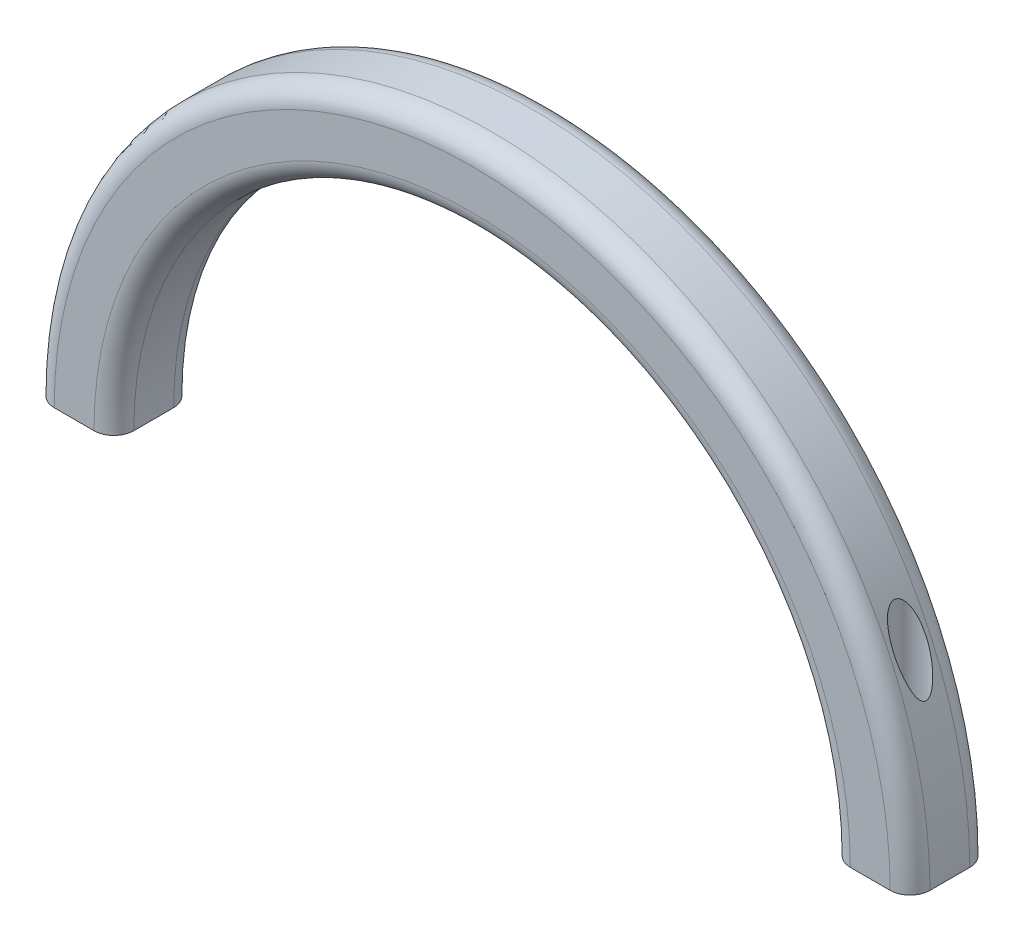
from build123d import *

# Parameters (mm, degrees)
BOSS_EXTRUDE1_DEPTH     = 6.35
F_1_4_20_TAPPED_HOLE1_D = 5.1054
FILLET1_R               = 3.175


with BuildPart() as part:
    # Sketch1 → Boss-Extrude1 (new, symmetric)
    with BuildSketch(Plane.XY):
        with BuildLine():
            ThreePointArc((69.85, 0), (0, 69.85), (-69.85, 0))
            Line((-69.85, 0), (-57.15, 0))
            ThreePointArc((-57.15, 0), (0, 57.15), (57.15, 0))
            Line((57.15, 0), (69.85, 0))
        make_face()
    extrude(amount=BOSS_EXTRUDE1_DEPTH, both=True)

    # 1_4-20 Tapped Hole1 (through all)
    with Locations(Plane(origin=(0, 0, 0), x_dir=(-1, 0, 0), z_dir=(0, -1, 0))):
        with Locations((63.5, 0), (-63.5, 0)):
            Hole(F_1_4_20_TAPPED_HOLE1_D / 2)

    # Fillet1
    fillet1_edges = [part.edges().sort_by_distance(p)[0] for p in [
        (0, 69.85, -6.35),
        (0, 57.15, -6.35),
        (0, 57.15, 6.35),
        (0, 69.85, 6.35),
    ]]
    fillet(fillet1_edges, radius=FILLET1_R)


solid = part.part
